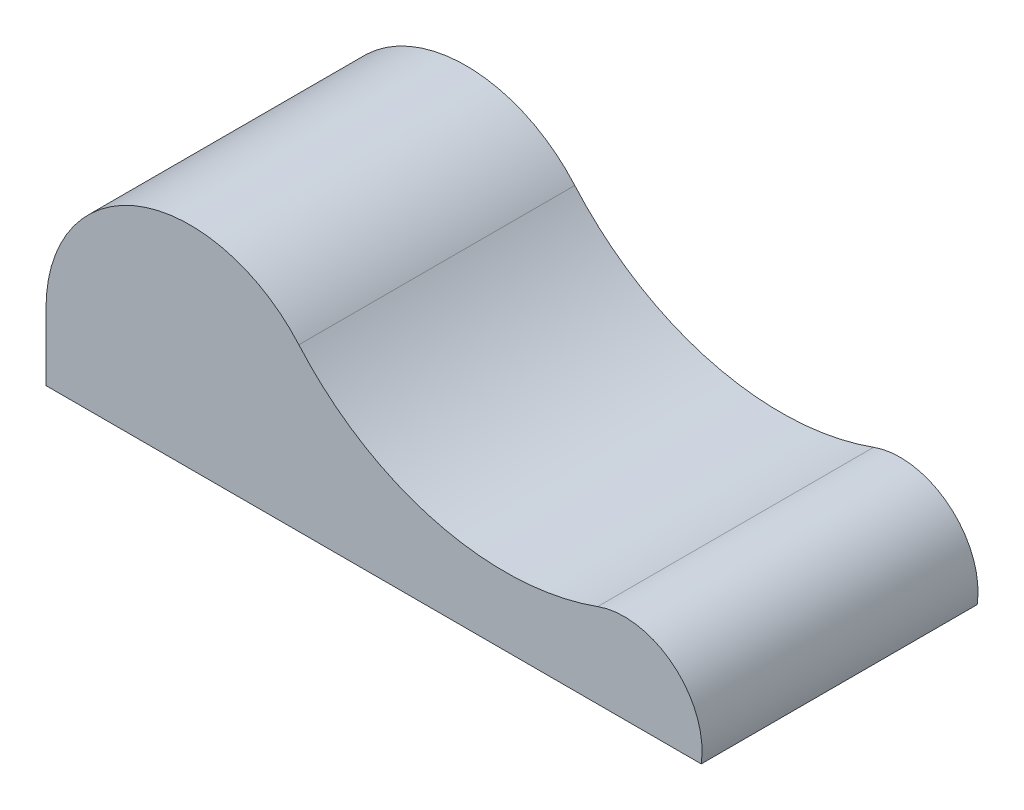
ISO-10303-21;
HEADER;
FILE_DESCRIPTION(('STEP AP214'),'2;1');
FILE_NAME('part.step','',(''),(''),'','','');
FILE_SCHEMA(('AUTOMOTIVE_DESIGN { 1 0 10303 214 1 1 1 1 }'));
ENDSEC;
DATA;
#1=APPLICATION_CONTEXT('core data for automotive mechanical design processes');
#2=APPLICATION_PROTOCOL_DEFINITION('international standard','automotive_design',2000,#1);
#3=PRODUCT_CONTEXT('',#1,'mechanical');
#4=PRODUCT('Part','Part','',(#3));
#5=PRODUCT_RELATED_PRODUCT_CATEGORY('part','',(#4));
#6=PRODUCT_DEFINITION_FORMATION('','',#4);
#7=PRODUCT_DEFINITION_CONTEXT('part definition',#1,'design');
#8=PRODUCT_DEFINITION('design','',#6,#7);
#9=PRODUCT_DEFINITION_SHAPE('','',#8);
#10=(LENGTH_UNIT() NAMED_UNIT(*) SI_UNIT(.MILLI.,.METRE.));
#11=(NAMED_UNIT(*) PLANE_ANGLE_UNIT() SI_UNIT($,.RADIAN.));
#12=(NAMED_UNIT(*) SI_UNIT($,.STERADIAN.) SOLID_ANGLE_UNIT());
#13=UNCERTAINTY_MEASURE_WITH_UNIT(LENGTH_MEASURE(1.E-05),#10,'distance_accuracy_value','');
#14=(GEOMETRIC_REPRESENTATION_CONTEXT(3) GLOBAL_UNCERTAINTY_ASSIGNED_CONTEXT((#13)) GLOBAL_UNIT_ASSIGNED_CONTEXT((#10,
#11,#12)) REPRESENTATION_CONTEXT('',''));
#15=CARTESIAN_POINT('',(0.,0.,0.));
#16=DIRECTION('',(0.,0.,1.));
#17=DIRECTION('',(1.,0.,0.));
#18=AXIS2_PLACEMENT_3D('',#15,#16,#17);
#19=CARTESIAN_POINT('',(64.4797166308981,2.9122330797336,35.5));
#20=DIRECTION('',(0.,0.,-1.));
#21=DIRECTION('',(-1.,0.,0.));
#22=AXIS2_PLACEMENT_3D('',#19,#20,#21);
#23=CYLINDRICAL_SURFACE('',#22,20.0304646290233);
#24=CARTESIAN_POINT('',(64.4797166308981,2.9122330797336,-35.5));
#25=DIRECTION('',(0.,0.,-1.));
#26=DIRECTION('',(-1.,0.,0.));
#27=AXIS2_PLACEMENT_3D('',#24,#25,#26);
#28=CIRCLE('',#27,20.0304646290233);
#29=CARTESIAN_POINT('',(57.6565336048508,21.7447498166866,-35.5));
#30=VERTEX_POINT('',#29);
#31=CARTESIAN_POINT('',(84.2973454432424,0.,-35.5));
#32=VERTEX_POINT('',#31);
#33=EDGE_CURVE('E110',#30,#32,#28,.T.);
#34=ORIENTED_EDGE('',*,*,#33,.F.);
#35=DIRECTION('',(0.,0.,-1.));
#36=VECTOR('',#35,1.);
#37=CARTESIAN_POINT('',(57.6565336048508,21.7447498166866,35.5));
#38=LINE('',#37,#36);
#39=CARTESIAN_POINT('',(57.6565336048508,21.7447498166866,35.5));
#40=VERTEX_POINT('',#39);
#41=EDGE_CURVE('E11',#40,#30,#38,.T.);
#42=ORIENTED_EDGE('',*,*,#41,.F.);
#43=CARTESIAN_POINT('',(64.4797166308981,2.9122330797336,35.5));
#44=DIRECTION('',(0.,0.,-1.));
#45=DIRECTION('',(-1.,0.,0.));
#46=AXIS2_PLACEMENT_3D('',#43,#44,#45);
#47=CIRCLE('',#46,20.0304646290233);
#48=CARTESIAN_POINT('',(84.2973454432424,0.,35.5));
#49=VERTEX_POINT('',#48);
#50=EDGE_CURVE('E105',#40,#49,#47,.T.);
#51=ORIENTED_EDGE('',*,*,#50,.T.);
#52=DIRECTION('',(0.,0.,-1.));
#53=VECTOR('',#52,1.);
#54=CARTESIAN_POINT('',(84.2973454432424,0.,35.5));
#55=LINE('',#54,#53);
#56=EDGE_CURVE('E36',#49,#32,#55,.T.);
#57=ORIENTED_EDGE('',*,*,#56,.T.);
#58=EDGE_LOOP('',(#34,#42,#51,#57));
#59=FACE_BOUND('',#58,.T.);
#60=ADVANCED_FACE('F33',(#59),#23,.T.);
#61=CARTESIAN_POINT('',(33.7224824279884,87.8045957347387,35.5));
#62=DIRECTION('',(0.,0.,-1.));
#63=DIRECTION('',(-1.,0.,0.));
#64=AXIS2_PLACEMENT_3D('',#61,#62,#63);
#65=CYLINDRICAL_SURFACE('',#64,70.2619530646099);
#66=CARTESIAN_POINT('',(33.7224824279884,87.8045957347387,-35.5));
#67=DIRECTION('',(0.,0.,1.));
#68=DIRECTION('',(1.,0.,0.));
#69=AXIS2_PLACEMENT_3D('',#66,#67,#68);
#70=CIRCLE('',#69,70.2619530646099);
#71=CARTESIAN_POINT('',(-19.2387031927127,41.6325818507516,-35.5));
#72=VERTEX_POINT('',#71);
#73=EDGE_CURVE('E119',#72,#30,#70,.T.);
#74=ORIENTED_EDGE('',*,*,#73,.F.);
#75=DIRECTION('',(0.,0.,-1.));
#76=VECTOR('',#75,1.);
#77=CARTESIAN_POINT('',(-19.2387031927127,41.6325818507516,35.5));
#78=LINE('',#77,#76);
#79=CARTESIAN_POINT('',(-19.2387031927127,41.6325818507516,35.5));
#80=VERTEX_POINT('',#79);
#81=EDGE_CURVE('E42',#80,#72,#78,.T.);
#82=ORIENTED_EDGE('',*,*,#81,.F.);
#83=CARTESIAN_POINT('',(33.7224824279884,87.8045957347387,35.5));
#84=DIRECTION('',(0.,0.,1.));
#85=DIRECTION('',(1.,0.,0.));
#86=AXIS2_PLACEMENT_3D('',#83,#84,#85);
#87=CIRCLE('',#86,70.2619530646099);
#88=EDGE_CURVE('E100',#80,#40,#87,.T.);
#89=ORIENTED_EDGE('',*,*,#88,.T.);
#90=ORIENTED_EDGE('',*,*,#41,.T.);
#91=EDGE_LOOP('',(#74,#82,#89,#90));
#92=FACE_BOUND('',#91,.T.);
#93=ADVANCED_FACE('F125',(#92),#65,.F.);
#94=CARTESIAN_POINT('',(-47.2008445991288,17.2549481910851,35.5));
#95=DIRECTION('',(0.,0.,-1.));
#96=DIRECTION('',(-1.,0.,0.));
#97=AXIS2_PLACEMENT_3D('',#94,#95,#96);
#98=CYLINDRICAL_SURFACE('',#97,37.0965008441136);
#99=CARTESIAN_POINT('',(-47.2008445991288,17.2549481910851,-35.5));
#100=DIRECTION('',(0.,0.,-1.));
#101=DIRECTION('',(-1.,0.,0.));
#102=AXIS2_PLACEMENT_3D('',#99,#100,#101);
#103=CIRCLE('',#102,37.0965008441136);
#104=CARTESIAN_POINT('',(-84.2973454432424,17.2549481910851,-35.5));
#105=VERTEX_POINT('',#104);
#106=EDGE_CURVE('E89',#105,#72,#103,.T.);
#107=ORIENTED_EDGE('',*,*,#106,.F.);
#108=DIRECTION('',(0.,0.,-1.));
#109=VECTOR('',#108,1.);
#110=CARTESIAN_POINT('',(-84.2973454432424,17.2549481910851,35.5));
#111=LINE('',#110,#109);
#112=CARTESIAN_POINT('',(-84.2973454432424,17.2549481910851,35.5));
#113=VERTEX_POINT('',#112);
#114=EDGE_CURVE('E84',#113,#105,#111,.T.);
#115=ORIENTED_EDGE('',*,*,#114,.F.);
#116=CARTESIAN_POINT('',(-47.2008445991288,17.2549481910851,35.5));
#117=DIRECTION('',(0.,0.,-1.));
#118=DIRECTION('',(-1.,0.,0.));
#119=AXIS2_PLACEMENT_3D('',#116,#117,#118);
#120=CIRCLE('',#119,37.0965008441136);
#121=EDGE_CURVE('E87',#113,#80,#120,.T.);
#122=ORIENTED_EDGE('',*,*,#121,.T.);
#123=ORIENTED_EDGE('',*,*,#81,.T.);
#124=EDGE_LOOP('',(#107,#115,#122,#123));
#125=FACE_BOUND('',#124,.T.);
#126=ADVANCED_FACE('F86',(#125),#98,.T.);
#127=CARTESIAN_POINT('',(-84.2973454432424,0.,35.5));
#128=DIRECTION('',(-1.,0.,0.));
#129=DIRECTION('',(0.,0.,1.));
#130=AXIS2_PLACEMENT_3D('',#127,#128,#129);
#131=PLANE('',#130);
#132=DIRECTION('',(0.,1.,0.));
#133=VECTOR('',#132,1.);
#134=CARTESIAN_POINT('',(-84.2973454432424,0.,-35.5));
#135=LINE('',#134,#133);
#136=CARTESIAN_POINT('',(-84.2973454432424,0.,-35.5));
#137=VERTEX_POINT('',#136);
#138=EDGE_CURVE('E116',#137,#105,#135,.T.);
#139=ORIENTED_EDGE('',*,*,#138,.F.);
#140=DIRECTION('',(0.,0.,-1.));
#141=VECTOR('',#140,1.);
#142=CARTESIAN_POINT('',(-84.2973454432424,0.,35.5));
#143=LINE('',#142,#141);
#144=CARTESIAN_POINT('',(-84.2973454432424,0.,35.5));
#145=VERTEX_POINT('',#144);
#146=EDGE_CURVE('E94',#145,#137,#143,.T.);
#147=ORIENTED_EDGE('',*,*,#146,.F.);
#148=DIRECTION('',(0.,1.,0.));
#149=VECTOR('',#148,1.);
#150=CARTESIAN_POINT('',(-84.2973454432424,0.,35.5));
#151=LINE('',#150,#149);
#152=EDGE_CURVE('E99',#145,#113,#151,.T.);
#153=ORIENTED_EDGE('',*,*,#152,.T.);
#154=ORIENTED_EDGE('',*,*,#114,.T.);
#155=EDGE_LOOP('',(#139,#147,#153,#154));
#156=FACE_BOUND('',#155,.T.);
#157=ADVANCED_FACE('F102',(#156),#131,.T.);
#158=CARTESIAN_POINT('',(84.2973454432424,0.,35.5));
#159=DIRECTION('',(0.,-1.,0.));
#160=DIRECTION('',(0.,0.,-1.));
#161=AXIS2_PLACEMENT_3D('',#158,#159,#160);
#162=PLANE('',#161);
#163=DIRECTION('',(-1.,0.,0.));
#164=VECTOR('',#163,1.);
#165=CARTESIAN_POINT('',(84.2973454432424,0.,-35.5));
#166=LINE('',#165,#164);
#167=EDGE_CURVE('E113',#32,#137,#166,.T.);
#168=ORIENTED_EDGE('',*,*,#167,.F.);
#169=ORIENTED_EDGE('',*,*,#56,.F.);
#170=DIRECTION('',(-1.,0.,0.));
#171=VECTOR('',#170,1.);
#172=CARTESIAN_POINT('',(84.2973454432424,0.,35.5));
#173=LINE('',#172,#171);
#174=EDGE_CURVE('E103',#49,#145,#173,.T.);
#175=ORIENTED_EDGE('',*,*,#174,.T.);
#176=ORIENTED_EDGE('',*,*,#146,.T.);
#177=EDGE_LOOP('',(#168,#169,#175,#176));
#178=FACE_BOUND('',#177,.T.);
#179=ADVANCED_FACE('F122',(#178),#162,.T.);
#180=CARTESIAN_POINT('',(64.4797166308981,2.9122330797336,35.5));
#181=DIRECTION('',(0.,0.,-1.));
#182=DIRECTION('',(-1.,0.,0.));
#183=AXIS2_PLACEMENT_3D('',#180,#181,#182);
#184=PLANE('',#183);
#185=ORIENTED_EDGE('',*,*,#50,.F.);
#186=ORIENTED_EDGE('',*,*,#88,.F.);
#187=ORIENTED_EDGE('',*,*,#121,.F.);
#188=ORIENTED_EDGE('',*,*,#152,.F.);
#189=ORIENTED_EDGE('',*,*,#174,.F.);
#190=EDGE_LOOP('',(#185,#186,#187,#188,#189));
#191=FACE_BOUND('',#190,.T.);
#192=ADVANCED_FACE('F98',(#191),#184,.F.);
#193=CARTESIAN_POINT('',(64.4797166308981,2.9122330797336,-35.5));
#194=DIRECTION('',(0.,0.,-1.));
#195=DIRECTION('',(-1.,0.,0.));
#196=AXIS2_PLACEMENT_3D('',#193,#194,#195);
#197=PLANE('',#196);
#198=ORIENTED_EDGE('',*,*,#33,.T.);
#199=ORIENTED_EDGE('',*,*,#167,.T.);
#200=ORIENTED_EDGE('',*,*,#138,.T.);
#201=ORIENTED_EDGE('',*,*,#106,.T.);
#202=ORIENTED_EDGE('',*,*,#73,.T.);
#203=EDGE_LOOP('',(#198,#199,#200,#201,#202));
#204=FACE_BOUND('',#203,.T.);
#205=ADVANCED_FACE('F124',(#204),#197,.T.);
#206=CLOSED_SHELL('',(#60,#93,#126,#157,#179,#192,#205));
#207=MANIFOLD_SOLID_BREP('B2',#206);
#208=ADVANCED_BREP_SHAPE_REPRESENTATION('',(#18,#207),#14);
#209=SHAPE_DEFINITION_REPRESENTATION(#9,#208);
ENDSEC;
END-ISO-10303-21;
